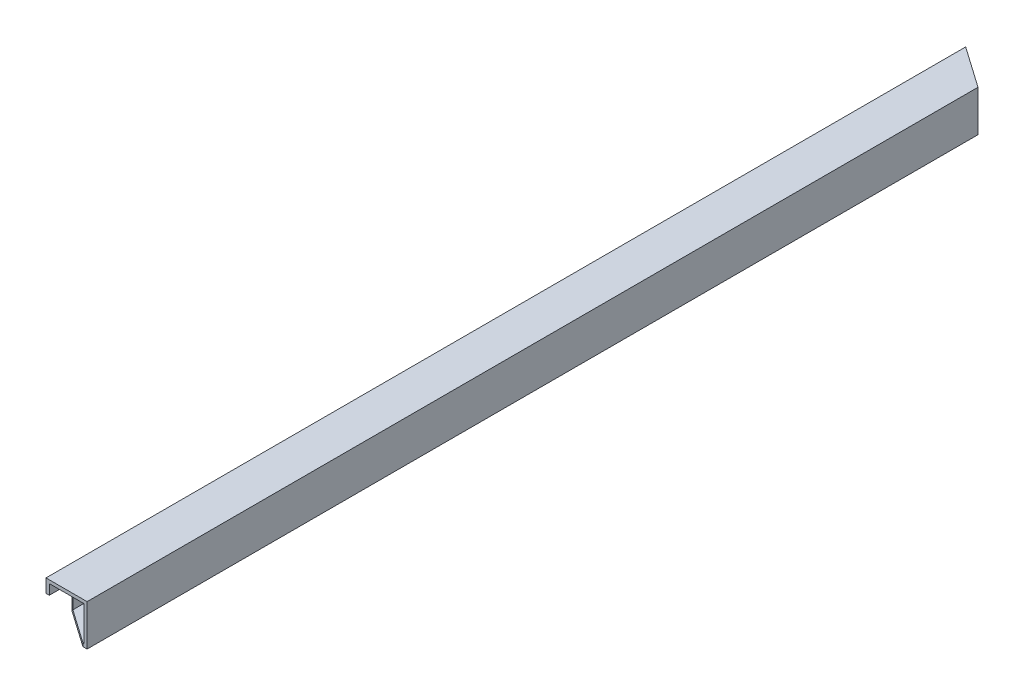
ISO-10303-21;
HEADER;
FILE_DESCRIPTION(('STEP AP214'),'2;1');
FILE_NAME('part.step','',(''),(''),'','','');
FILE_SCHEMA(('AUTOMOTIVE_DESIGN { 1 0 10303 214 1 1 1 1 }'));
ENDSEC;
DATA;
#1=APPLICATION_CONTEXT('core data for automotive mechanical design processes');
#2=APPLICATION_PROTOCOL_DEFINITION('international standard','automotive_design',2000,#1);
#3=PRODUCT_CONTEXT('',#1,'mechanical');
#4=PRODUCT('Part','Part','',(#3));
#5=PRODUCT_RELATED_PRODUCT_CATEGORY('part','',(#4));
#6=PRODUCT_DEFINITION_FORMATION('','',#4);
#7=PRODUCT_DEFINITION_CONTEXT('part definition',#1,'design');
#8=PRODUCT_DEFINITION('design','',#6,#7);
#9=PRODUCT_DEFINITION_SHAPE('','',#8);
#10=(LENGTH_UNIT() NAMED_UNIT(*) SI_UNIT(.MILLI.,.METRE.));
#11=(NAMED_UNIT(*) PLANE_ANGLE_UNIT() SI_UNIT($,.RADIAN.));
#12=(NAMED_UNIT(*) SI_UNIT($,.STERADIAN.) SOLID_ANGLE_UNIT());
#13=UNCERTAINTY_MEASURE_WITH_UNIT(LENGTH_MEASURE(1.E-05),#10,'distance_accuracy_value','');
#14=(GEOMETRIC_REPRESENTATION_CONTEXT(3) GLOBAL_UNCERTAINTY_ASSIGNED_CONTEXT((#13)) GLOBAL_UNIT_ASSIGNED_CONTEXT((#10,
#11,#12)) REPRESENTATION_CONTEXT('',''));
#15=CARTESIAN_POINT('',(0.,0.,0.));
#16=DIRECTION('',(0.,0.,1.));
#17=DIRECTION('',(1.,0.,0.));
#18=AXIS2_PLACEMENT_3D('',#15,#16,#17);
#19=CARTESIAN_POINT('',(-675.6346651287,19.766692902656,616.40200591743));
#20=DIRECTION('',(0.81912197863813,-0.0163824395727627,0.573385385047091));
#21=DIRECTION('',(-0.0199960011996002,-0.999800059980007,0.));
#22=AXIS2_PLACEMENT_3D('',#19,#20,#21);
#23=CYLINDRICAL_SURFACE('',#22,2.);
#24=CARTESIAN_POINT('',(-21.,6.67399960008,1074.646271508));
#25=DIRECTION('',(1.,0.,0.));
#26=DIRECTION('',(0.,-0.0285597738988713,0.999592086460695));
#27=AXIS2_PLACEMENT_3D('',#24,#25,#26);
#28=ELLIPSE('',#27,2.441638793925,2.);
#29=CARTESIAN_POINT('',(-21.,6.67399960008,1072.205120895));
#30=VERTEX_POINT('',#29);
#31=CARTESIAN_POINT('',(-21.,8.674399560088,1074.618277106));
#32=VERTEX_POINT('',#31);
#33=EDGE_CURVE('E24',#30,#32,#28,.T.);
#34=ORIENTED_EDGE('',*,*,#33,.T.);
#35=DIRECTION('',(0.819121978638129,-0.0163824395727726,0.573385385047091));
#36=VECTOR('',#35,1.);
#37=CARTESIAN_POINT('',(-675.5946731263,21.766293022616,616.40200591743));
#38=LINE('',#37,#36);
#39=CARTESIAN_POINT('',(-25.,8.754399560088,1071.818277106));
#40=VERTEX_POINT('',#39);
#41=EDGE_CURVE('E10',#40,#32,#38,.T.);
#42=ORIENTED_EDGE('',*,*,#41,.F.);
#43=CARTESIAN_POINT('',(-25.,6.75399960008,1071.846271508));
#44=DIRECTION('',(1.,0.,0.));
#45=DIRECTION('',(0.,-0.0285597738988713,0.999592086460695));
#46=AXIS2_PLACEMENT_3D('',#43,#44,#45);
#47=ELLIPSE('',#46,2.441638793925,2.);
#48=CARTESIAN_POINT('',(-25.,6.75399960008,1069.405120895));
#49=VERTEX_POINT('',#48);
#50=EDGE_CURVE('E217',#49,#40,#47,.T.);
#51=ORIENTED_EDGE('',*,*,#50,.F.);
#52=DIRECTION('',(0.819121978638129,-0.0163824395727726,0.573385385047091));
#53=VECTOR('',#52,1.);
#54=CARTESIAN_POINT('',(-674.488123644,19.743762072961,614.76343434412));
#55=LINE('',#54,#53);
#56=EDGE_CURVE('E237',#49,#30,#55,.T.);
#57=ORIENTED_EDGE('',*,*,#56,.T.);
#58=EDGE_LOOP('',(#34,#42,#51,#57));
#59=FACE_BOUND('',#58,.T.);
#60=ADVANCED_FACE('F16',(#59),#23,.F.);
#61=CARTESIAN_POINT('',(-675.5946731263,21.766293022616,616.40200591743));
#62=DIRECTION('',(-0.0199960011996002,-0.999800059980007,0.));
#63=DIRECTION('',(-0.999800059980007,0.0199960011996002,0.));
#64=AXIS2_PLACEMENT_3D('',#61,#62,#63);
#65=PLANE('',#64);
#66=DIRECTION('',(0.,0.,-1.));
#67=VECTOR('',#66,1.);
#68=CARTESIAN_POINT('',(-25.,8.754399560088,295.70100295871));
#69=LINE('',#68,#67);
#70=CARTESIAN_POINT('',(-25.,8.754399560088,1101.26844483));
#71=VERTEX_POINT('',#70);
#72=EDGE_CURVE('E249',#71,#40,#69,.T.);
#73=ORIENTED_EDGE('',*,*,#72,.T.);
#74=ORIENTED_EDGE('',*,*,#41,.T.);
#75=DIRECTION('',(0.,0.,-1.));
#76=VECTOR('',#75,1.);
#77=CARTESIAN_POINT('',(-21.,8.674399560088,295.70100295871));
#78=LINE('',#77,#76);
#79=CARTESIAN_POINT('',(-21.,8.674399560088,1101.26844483));
#80=VERTEX_POINT('',#79);
#81=EDGE_CURVE('E212',#80,#32,#78,.T.);
#82=ORIENTED_EDGE('',*,*,#81,.F.);
#83=DIRECTION('',(-0.999800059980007,0.0199960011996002,0.));
#84=VECTOR('',#83,1.);
#85=CARTESIAN_POINT('',(-337.7148255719,15.008696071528,1101.26844483));
#86=LINE('',#85,#84);
#87=EDGE_CURVE('E178',#80,#71,#86,.T.);
#88=ORIENTED_EDGE('',*,*,#87,.T.);
#89=EDGE_LOOP('',(#73,#74,#82,#88));
#90=FACE_BOUND('',#89,.T.);
#91=ADVANCED_FACE('F275',(#90),#65,.T.);
#92=CARTESIAN_POINT('',(-21.,21.,-25.));
#93=DIRECTION('',(1.,0.,0.));
#94=DIRECTION('',(0.,1.,0.));
#95=AXIS2_PLACEMENT_3D('',#92,#93,#94);
#96=PLANE('',#95);
#97=DIRECTION('',(0.,-1.,0.));
#98=VECTOR('',#97,1.);
#99=CARTESIAN_POINT('',(-21.,10.5,-14.7));
#100=LINE('',#99,#98);
#101=CARTESIAN_POINT('',(-21.,21.,-14.7));
#102=VERTEX_POINT('',#101);
#103=CARTESIAN_POINT('',(-21.,-21.,-14.7));
#104=VERTEX_POINT('',#103);
#105=EDGE_CURVE('E170',#102,#104,#100,.T.);
#106=ORIENTED_EDGE('',*,*,#105,.F.);
#107=DIRECTION('',(0.,0.,1.));
#108=VECTOR('',#107,1.);
#109=CARTESIAN_POINT('',(-21.,21.,-25.));
#110=LINE('',#109,#108);
#111=CARTESIAN_POINT('',(-21.,21.,1101.26844483));
#112=VERTEX_POINT('',#111);
#113=EDGE_CURVE('E264',#102,#112,#110,.T.);
#114=ORIENTED_EDGE('',*,*,#113,.T.);
#115=DIRECTION('',(0.,1.,0.));
#116=VECTOR('',#115,1.);
#117=CARTESIAN_POINT('',(-21.,10.5,1101.26844483));
#118=LINE('',#117,#116);
#119=EDGE_CURVE('E182',#80,#112,#118,.T.);
#120=ORIENTED_EDGE('',*,*,#119,.F.);
#121=ORIENTED_EDGE('',*,*,#81,.T.);
#122=ORIENTED_EDGE('',*,*,#33,.F.);
#123=DIRECTION('',(0.,-0.999902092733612,0.0139930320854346));
#124=VECTOR('',#123,1.);
#125=CARTESIAN_POINT('',(-21.,11.253159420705,1072.141038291));
#126=LINE('',#125,#124);
#127=CARTESIAN_POINT('',(-21.,-21.,1072.592401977));
#128=VERTEX_POINT('',#127);
#129=EDGE_CURVE('E213',#30,#128,#126,.T.);
#130=ORIENTED_EDGE('',*,*,#129,.T.);
#131=DIRECTION('',(0.,0.,1.));
#132=VECTOR('',#131,1.);
#133=CARTESIAN_POINT('',(-21.,-21.,-25.));
#134=LINE('',#133,#132);
#135=EDGE_CURVE('E255',#104,#128,#134,.T.);
#136=ORIENTED_EDGE('',*,*,#135,.F.);
#137=EDGE_LOOP('',(#106,#114,#120,#121,#122,#130,#136));
#138=FACE_BOUND('',#137,.T.);
#139=ADVANCED_FACE('F272',(#138),#96,.T.);
#140=CARTESIAN_POINT('',(21.,21.,-25.));
#141=DIRECTION('',(0.,-1.,0.));
#142=DIRECTION('',(0.,0.,-1.));
#143=AXIS2_PLACEMENT_3D('',#140,#141,#142);
#144=PLANE('',#143);
#145=DIRECTION('',(-0.819231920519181,0.,-0.573462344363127));
#146=VECTOR('',#145,1.);
#147=CARTESIAN_POINT('',(1.174496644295,21.,0.822147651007));
#148=LINE('',#147,#146);
#149=CARTESIAN_POINT('',(21.,21.,14.7));
#150=VERTEX_POINT('',#149);
#151=EDGE_CURVE('E175',#150,#102,#148,.T.);
#152=ORIENTED_EDGE('',*,*,#151,.F.);
#153=DIRECTION('',(0.,0.,1.));
#154=VECTOR('',#153,1.);
#155=CARTESIAN_POINT('',(21.,21.,-25.));
#156=LINE('',#155,#154);
#157=CARTESIAN_POINT('',(21.,21.,1101.26844483));
#158=VERTEX_POINT('',#157);
#159=EDGE_CURVE('E261',#150,#158,#156,.T.);
#160=ORIENTED_EDGE('',*,*,#159,.T.);
#161=DIRECTION('',(1.,0.,0.));
#162=VECTOR('',#161,1.);
#163=CARTESIAN_POINT('',(10.5,21.,1101.26844483));
#164=LINE('',#163,#162);
#165=EDGE_CURVE('E224',#112,#158,#164,.T.);
#166=ORIENTED_EDGE('',*,*,#165,.F.);
#167=ORIENTED_EDGE('',*,*,#113,.F.);
#168=EDGE_LOOP('',(#152,#160,#166,#167));
#169=FACE_BOUND('',#168,.T.);
#170=ADVANCED_FACE('F295',(#169),#144,.T.);
#171=CARTESIAN_POINT('',(21.,-21.,-25.));
#172=DIRECTION('',(-1.,0.,0.));
#173=DIRECTION('',(0.,0.,1.));
#174=AXIS2_PLACEMENT_3D('',#171,#172,#173);
#175=PLANE('',#174);
#176=DIRECTION('',(0.,1.,0.));
#177=VECTOR('',#176,1.);
#178=CARTESIAN_POINT('',(21.,-10.5,14.7));
#179=LINE('',#178,#177);
#180=CARTESIAN_POINT('',(21.,-21.,14.7));
#181=VERTEX_POINT('',#180);
#182=EDGE_CURVE('E200',#181,#150,#179,.T.);
#183=ORIENTED_EDGE('',*,*,#182,.F.);
#184=DIRECTION('',(0.,0.,1.));
#185=VECTOR('',#184,1.);
#186=CARTESIAN_POINT('',(21.,-21.,-25.));
#187=LINE('',#186,#185);
#188=CARTESIAN_POINT('',(21.,-21.,1101.26844483));
#189=VERTEX_POINT('',#188);
#190=EDGE_CURVE('E258',#181,#189,#187,.T.);
#191=ORIENTED_EDGE('',*,*,#190,.T.);
#192=DIRECTION('',(0.,-1.,0.));
#193=VECTOR('',#192,1.);
#194=CARTESIAN_POINT('',(21.,-10.5,1101.26844483));
#195=LINE('',#194,#193);
#196=EDGE_CURVE('E197',#158,#189,#195,.T.);
#197=ORIENTED_EDGE('',*,*,#196,.F.);
#198=ORIENTED_EDGE('',*,*,#159,.F.);
#199=EDGE_LOOP('',(#183,#191,#197,#198));
#200=FACE_BOUND('',#199,.T.);
#201=ADVANCED_FACE('F299',(#200),#175,.T.);
#202=CARTESIAN_POINT('',(-21.,-21.,-25.));
#203=DIRECTION('',(0.,1.,0.));
#204=DIRECTION('',(1.,0.,0.));
#205=AXIS2_PLACEMENT_3D('',#202,#203,#204);
#206=PLANE('',#205);
#207=DIRECTION('',(0.819231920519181,0.,0.573462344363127));
#208=VECTOR('',#207,1.);
#209=CARTESIAN_POINT('',(-12.91946308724,-21.,-9.043624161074));
#210=LINE('',#209,#208);
#211=EDGE_CURVE('E174',#104,#181,#210,.T.);
#212=ORIENTED_EDGE('',*,*,#211,.F.);
#213=ORIENTED_EDGE('',*,*,#135,.T.);
#214=DIRECTION('',(0.819339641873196,0.,0.573308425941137));
#215=VECTOR('',#214,1.);
#216=CARTESIAN_POINT('',(-605.9348632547,-21.,663.30171397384));
#217=LINE('',#216,#215);
#218=CARTESIAN_POINT('',(19.982161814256,-21.,1101.26844483));
#219=VERTEX_POINT('',#218);
#220=EDGE_CURVE('E218',#128,#219,#217,.T.);
#221=ORIENTED_EDGE('',*,*,#220,.T.);
#222=DIRECTION('',(-1.,0.,0.));
#223=VECTOR('',#222,1.);
#224=CARTESIAN_POINT('',(-10.5,-21.,1101.26844483));
#225=LINE('',#224,#223);
#226=EDGE_CURVE('E192',#189,#219,#225,.T.);
#227=ORIENTED_EDGE('',*,*,#226,.F.);
#228=ORIENTED_EDGE('',*,*,#190,.F.);
#229=EDGE_LOOP('',(#212,#213,#221,#227,#228));
#230=FACE_BOUND('',#229,.T.);
#231=ADVANCED_FACE('F289',(#230),#206,.T.);
#232=CARTESIAN_POINT('',(25.,25.,-25.));
#233=DIRECTION('',(0.,-1.,0.));
#234=DIRECTION('',(0.,0.,-1.));
#235=AXIS2_PLACEMENT_3D('',#232,#233,#234);
#236=PLANE('',#235);
#237=DIRECTION('',(0.,0.,1.));
#238=VECTOR('',#237,1.);
#239=CARTESIAN_POINT('',(-25.,25.,-25.));
#240=LINE('',#239,#238);
#241=CARTESIAN_POINT('',(-25.,25.,-17.5));
#242=VERTEX_POINT('',#241);
#243=CARTESIAN_POINT('',(-25.,25.,1101.26844483));
#244=VERTEX_POINT('',#243);
#245=EDGE_CURVE('E252',#242,#244,#240,.T.);
#246=ORIENTED_EDGE('',*,*,#245,.T.);
#247=DIRECTION('',(1.,0.,0.));
#248=VECTOR('',#247,1.);
#249=CARTESIAN_POINT('',(12.5,25.,1101.26844483));
#250=LINE('',#249,#248);
#251=CARTESIAN_POINT('',(25.,25.,1101.26844483));
#252=VERTEX_POINT('',#251);
#253=EDGE_CURVE('E234',#244,#252,#250,.T.);
#254=ORIENTED_EDGE('',*,*,#253,.T.);
#255=DIRECTION('',(0.,0.,1.));
#256=VECTOR('',#255,1.);
#257=CARTESIAN_POINT('',(25.,25.,-25.));
#258=LINE('',#257,#256);
#259=CARTESIAN_POINT('',(25.,25.,17.5));
#260=VERTEX_POINT('',#259);
#261=EDGE_CURVE('E188',#260,#252,#258,.T.);
#262=ORIENTED_EDGE('',*,*,#261,.F.);
#263=DIRECTION('',(-0.819231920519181,0.,-0.573462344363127));
#264=VECTOR('',#263,1.);
#265=CARTESIAN_POINT('',(2.51677852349,25.,1.761744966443));
#266=LINE('',#265,#264);
#267=EDGE_CURVE('E138',#260,#242,#266,.T.);
#268=ORIENTED_EDGE('',*,*,#267,.T.);
#269=EDGE_LOOP('',(#246,#254,#262,#268));
#270=FACE_BOUND('',#269,.T.);
#271=ADVANCED_FACE('F301',(#270),#236,.F.);
#272=CARTESIAN_POINT('',(-25.,25.,-25.));
#273=DIRECTION('',(1.,0.,0.));
#274=DIRECTION('',(0.,1.,0.));
#275=AXIS2_PLACEMENT_3D('',#272,#273,#274);
#276=PLANE('',#275);
#277=DIRECTION('',(0.,0.,1.));
#278=VECTOR('',#277,1.);
#279=CARTESIAN_POINT('',(-25.,-25.,-25.));
#280=LINE('',#279,#278);
#281=CARTESIAN_POINT('',(-25.,-25.,-17.5));
#282=VERTEX_POINT('',#281);
#283=CARTESIAN_POINT('',(-25.,-25.,1069.849499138));
#284=VERTEX_POINT('',#283);
#285=EDGE_CURVE('E152',#282,#284,#280,.T.);
#286=ORIENTED_EDGE('',*,*,#285,.T.);
#287=DIRECTION('',(0.,-0.999902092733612,0.0139930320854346));
#288=VECTOR('',#287,1.);
#289=CARTESIAN_POINT('',(-25.,13.213606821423,1069.314722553));
#290=LINE('',#289,#288);
#291=EDGE_CURVE('E241',#49,#284,#290,.T.);
#292=ORIENTED_EDGE('',*,*,#291,.F.);
#293=ORIENTED_EDGE('',*,*,#50,.T.);
#294=ORIENTED_EDGE('',*,*,#72,.F.);
#295=DIRECTION('',(0.,1.,0.));
#296=VECTOR('',#295,1.);
#297=CARTESIAN_POINT('',(-25.,12.5,1101.26844483));
#298=LINE('',#297,#296);
#299=EDGE_CURVE('E183',#71,#244,#298,.T.);
#300=ORIENTED_EDGE('',*,*,#299,.T.);
#301=ORIENTED_EDGE('',*,*,#245,.F.);
#302=DIRECTION('',(0.,-1.,0.));
#303=VECTOR('',#302,1.);
#304=CARTESIAN_POINT('',(-25.,12.5,-17.5));
#305=LINE('',#304,#303);
#306=EDGE_CURVE('E143',#242,#282,#305,.T.);
#307=ORIENTED_EDGE('',*,*,#306,.T.);
#308=EDGE_LOOP('',(#286,#292,#293,#294,#300,#301,#307));
#309=FACE_BOUND('',#308,.T.);
#310=ADVANCED_FACE('F281',(#309),#276,.F.);
#311=CARTESIAN_POINT('',(-675.287963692,-20.24824032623,614.76343434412));
#312=DIRECTION('',(-0.573270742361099,0.011465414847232,0.819285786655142));
#313=DIRECTION('',(0.0199960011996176,0.999800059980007,0.));
#314=AXIS2_PLACEMENT_3D('',#311,#312,#313);
#315=PLANE('',#314);
#316=ORIENTED_EDGE('',*,*,#56,.F.);
#317=ORIENTED_EDGE('',*,*,#291,.T.);
#318=DIRECTION('',(0.819339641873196,0.,0.573308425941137));
#319=VECTOR('',#318,1.);
#320=CARTESIAN_POINT('',(-607.3037927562,-25.,662.39982407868));
#321=LINE('',#320,#319);
#322=CARTESIAN_POINT('',(19.902161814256,-25.,1101.26844483));
#323=VERTEX_POINT('',#322);
#324=EDGE_CURVE('E165',#284,#323,#321,.T.);
#325=ORIENTED_EDGE('',*,*,#324,.T.);
#326=DIRECTION('',(0.0199960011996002,0.999800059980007,0.));
#327=VECTOR('',#326,1.);
#328=CARTESIAN_POINT('',(20.056599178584,-17.27813178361,1101.26844483));
#329=LINE('',#328,#327);
#330=EDGE_CURVE('E196',#323,#219,#329,.T.);
#331=ORIENTED_EDGE('',*,*,#330,.T.);
#332=ORIENTED_EDGE('',*,*,#220,.F.);
#333=ORIENTED_EDGE('',*,*,#129,.F.);
#334=EDGE_LOOP('',(#316,#317,#325,#331,#332,#333));
#335=FACE_BOUND('',#334,.T.);
#336=ADVANCED_FACE('F285',(#335),#315,.T.);
#337=CARTESIAN_POINT('',(0.,0.,1101.26844483));
#338=DIRECTION('',(0.,0.,-1.));
#339=DIRECTION('',(0.,-1.,0.));
#340=AXIS2_PLACEMENT_3D('',#337,#338,#339);
#341=PLANE('',#340);
#342=ORIENTED_EDGE('',*,*,#299,.F.);
#343=ORIENTED_EDGE('',*,*,#87,.F.);
#344=ORIENTED_EDGE('',*,*,#119,.T.);
#345=ORIENTED_EDGE('',*,*,#165,.T.);
#346=ORIENTED_EDGE('',*,*,#196,.T.);
#347=ORIENTED_EDGE('',*,*,#226,.T.);
#348=ORIENTED_EDGE('',*,*,#330,.F.);
#349=DIRECTION('',(-1.,0.,0.));
#350=VECTOR('',#349,1.);
#351=CARTESIAN_POINT('',(-12.5,-25.,1101.26844483));
#352=LINE('',#351,#350);
#353=CARTESIAN_POINT('',(25.,-25.,1101.26844483));
#354=VERTEX_POINT('',#353);
#355=EDGE_CURVE('E160',#354,#323,#352,.T.);
#356=ORIENTED_EDGE('',*,*,#355,.F.);
#357=DIRECTION('',(0.,-1.,0.));
#358=VECTOR('',#357,1.);
#359=CARTESIAN_POINT('',(25.,-12.5,1101.26844483));
#360=LINE('',#359,#358);
#361=EDGE_CURVE('E157',#252,#354,#360,.T.);
#362=ORIENTED_EDGE('',*,*,#361,.F.);
#363=ORIENTED_EDGE('',*,*,#253,.F.);
#364=EDGE_LOOP('',(#342,#343,#344,#345,#346,#347,#348,#356,#362,#363));
#365=FACE_BOUND('',#364,.T.);
#366=ADVANCED_FACE('F279',(#365),#341,.F.);
#367=CARTESIAN_POINT('',(25.,-25.,-25.));
#368=DIRECTION('',(-1.,0.,0.));
#369=DIRECTION('',(0.,0.,1.));
#370=AXIS2_PLACEMENT_3D('',#367,#368,#369);
#371=PLANE('',#370);
#372=ORIENTED_EDGE('',*,*,#261,.T.);
#373=ORIENTED_EDGE('',*,*,#361,.T.);
#374=DIRECTION('',(0.,0.,1.));
#375=VECTOR('',#374,1.);
#376=CARTESIAN_POINT('',(25.,-25.,-25.));
#377=LINE('',#376,#375);
#378=CARTESIAN_POINT('',(25.,-25.,17.5));
#379=VERTEX_POINT('',#378);
#380=EDGE_CURVE('E149',#379,#354,#377,.T.);
#381=ORIENTED_EDGE('',*,*,#380,.F.);
#382=DIRECTION('',(0.,1.,0.));
#383=VECTOR('',#382,1.);
#384=CARTESIAN_POINT('',(25.,-12.5,17.5));
#385=LINE('',#384,#383);
#386=EDGE_CURVE('E131',#379,#260,#385,.T.);
#387=ORIENTED_EDGE('',*,*,#386,.T.);
#388=EDGE_LOOP('',(#372,#373,#381,#387));
#389=FACE_BOUND('',#388,.T.);
#390=ADVANCED_FACE('F155',(#389),#371,.F.);
#391=CARTESIAN_POINT('',(0.,0.,0.));
#392=DIRECTION('',(-0.573462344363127,0.,0.819231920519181));
#393=DIRECTION('',(0.,1.,0.));
#394=AXIS2_PLACEMENT_3D('',#391,#392,#393);
#395=PLANE('',#394);
#396=ORIENTED_EDGE('',*,*,#182,.T.);
#397=ORIENTED_EDGE('',*,*,#151,.T.);
#398=ORIENTED_EDGE('',*,*,#105,.T.);
#399=ORIENTED_EDGE('',*,*,#211,.T.);
#400=EDGE_LOOP('',(#396,#397,#398,#399));
#401=FACE_BOUND('',#400,.T.);
#402=ORIENTED_EDGE('',*,*,#267,.F.);
#403=ORIENTED_EDGE('',*,*,#386,.F.);
#404=DIRECTION('',(0.819231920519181,0.,0.573462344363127));
#405=VECTOR('',#404,1.);
#406=CARTESIAN_POINT('',(-14.26174496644,-25.,-9.98322147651));
#407=LINE('',#406,#405);
#408=EDGE_CURVE('E135',#282,#379,#407,.T.);
#409=ORIENTED_EDGE('',*,*,#408,.F.);
#410=ORIENTED_EDGE('',*,*,#306,.F.);
#411=EDGE_LOOP('',(#402,#403,#409,#410));
#412=FACE_BOUND('',#411,.T.);
#413=ADVANCED_FACE('F133',(#401,#412),#395,.F.);
#414=CARTESIAN_POINT('',(-25.,-25.,-25.));
#415=DIRECTION('',(0.,1.,0.));
#416=DIRECTION('',(1.,0.,0.));
#417=AXIS2_PLACEMENT_3D('',#414,#415,#416);
#418=PLANE('',#417);
#419=ORIENTED_EDGE('',*,*,#380,.T.);
#420=ORIENTED_EDGE('',*,*,#355,.T.);
#421=ORIENTED_EDGE('',*,*,#324,.F.);
#422=ORIENTED_EDGE('',*,*,#285,.F.);
#423=ORIENTED_EDGE('',*,*,#408,.T.);
#424=EDGE_LOOP('',(#419,#420,#421,#422,#423));
#425=FACE_BOUND('',#424,.T.);
#426=ADVANCED_FACE('F147',(#425),#418,.F.);
#427=CLOSED_SHELL('',(#60,#91,#139,#170,#201,#231,#271,#310,#336,#366,#390,#413,#426));
#428=MANIFOLD_SOLID_BREP('B1',#427);
#429=ADVANCED_BREP_SHAPE_REPRESENTATION('',(#18,#428),#14);
#430=SHAPE_DEFINITION_REPRESENTATION(#9,#429);
ENDSEC;
END-ISO-10303-21;
